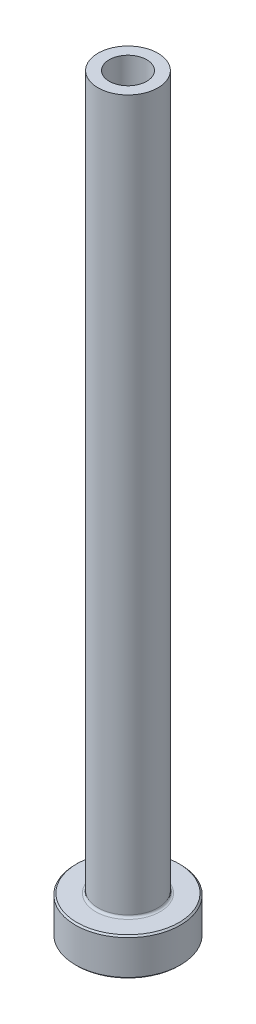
ISO-10303-21;
HEADER;
FILE_DESCRIPTION(('STEP AP214'),'2;1');
FILE_NAME('part.step','',(''),(''),'','','');
FILE_SCHEMA(('AUTOMOTIVE_DESIGN { 1 0 10303 214 1 1 1 1 }'));
ENDSEC;
DATA;
#1=APPLICATION_CONTEXT('core data for automotive mechanical design processes');
#2=APPLICATION_PROTOCOL_DEFINITION('international standard','automotive_design',2000,#1);
#3=PRODUCT_CONTEXT('',#1,'mechanical');
#4=PRODUCT('Part','Part','',(#3));
#5=PRODUCT_RELATED_PRODUCT_CATEGORY('part','',(#4));
#6=PRODUCT_DEFINITION_FORMATION('','',#4);
#7=PRODUCT_DEFINITION_CONTEXT('part definition',#1,'design');
#8=PRODUCT_DEFINITION('design','',#6,#7);
#9=PRODUCT_DEFINITION_SHAPE('','',#8);
#10=(LENGTH_UNIT() NAMED_UNIT(*) SI_UNIT(.MILLI.,.METRE.));
#11=(NAMED_UNIT(*) PLANE_ANGLE_UNIT() SI_UNIT($,.RADIAN.));
#12=(NAMED_UNIT(*) SI_UNIT($,.STERADIAN.) SOLID_ANGLE_UNIT());
#13=UNCERTAINTY_MEASURE_WITH_UNIT(LENGTH_MEASURE(1.E-05),#10,'distance_accuracy_value','');
#14=(GEOMETRIC_REPRESENTATION_CONTEXT(3) GLOBAL_UNCERTAINTY_ASSIGNED_CONTEXT((#13)) GLOBAL_UNIT_ASSIGNED_CONTEXT((#10,
#11,#12)) REPRESENTATION_CONTEXT('',''));
#15=CARTESIAN_POINT('',(0.,0.,0.));
#16=DIRECTION('',(0.,0.,1.));
#17=DIRECTION('',(1.,0.,0.));
#18=AXIS2_PLACEMENT_3D('',#15,#16,#17);
#19=CARTESIAN_POINT('',(0.,92.1876809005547,0.));
#20=DIRECTION('',(0.,1.,0.));
#21=DIRECTION('',(0.,0.,1.));
#22=AXIS2_PLACEMENT_3D('',#19,#20,#21);
#23=CYLINDRICAL_SURFACE('',#22,2.49999999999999);
#24=CARTESIAN_POINT('',(0.,100.,0.));
#25=DIRECTION('',(0.,1.,0.));
#26=DIRECTION('',(0.,0.,1.));
#27=AXIS2_PLACEMENT_3D('',#24,#25,#26);
#28=CIRCLE('',#27,2.49999999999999);
#29=CARTESIAN_POINT('',(0.,100.,2.49999999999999));
#30=VERTEX_POINT('',#29);
#31=EDGE_CURVE('E62',#30,#30,#28,.T.);
#32=ORIENTED_EDGE('',*,*,#31,.T.);
#33=EDGE_LOOP('',(#32));
#34=FACE_BOUND('',#33,.T.);
#35=CARTESIAN_POINT('',(0.,55.,0.));
#36=DIRECTION('',(0.,1.,0.));
#37=DIRECTION('',(0.,0.,1.));
#38=AXIS2_PLACEMENT_3D('',#35,#36,#37);
#39=CIRCLE('',#38,2.49999999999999);
#40=CARTESIAN_POINT('',(0.,55.,2.49999999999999));
#41=VERTEX_POINT('',#40);
#42=EDGE_CURVE('E71',#41,#41,#39,.T.);
#43=ORIENTED_EDGE('',*,*,#42,.F.);
#44=EDGE_LOOP('',(#43));
#45=FACE_BOUND('',#44,.T.);
#46=ADVANCED_FACE('F30',(#34,#45),#23,.F.);
#47=CARTESIAN_POINT('',(-2.49999999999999,100.,0.));
#48=DIRECTION('',(0.,1.,0.));
#49=DIRECTION('',(0.,0.,1.));
#50=AXIS2_PLACEMENT_3D('',#47,#48,#49);
#51=PLANE('',#50);
#52=CARTESIAN_POINT('',(0.,100.,0.));
#53=DIRECTION('',(0.,1.,0.));
#54=DIRECTION('',(0.,0.,1.));
#55=AXIS2_PLACEMENT_3D('',#52,#53,#54);
#56=CIRCLE('',#55,4.);
#57=CARTESIAN_POINT('',(0.,100.,4.));
#58=VERTEX_POINT('',#57);
#59=EDGE_CURVE('E65',#58,#58,#56,.T.);
#60=ORIENTED_EDGE('',*,*,#59,.T.);
#61=EDGE_LOOP('',(#60));
#62=FACE_BOUND('',#61,.T.);
#63=ORIENTED_EDGE('',*,*,#31,.F.);
#64=EDGE_LOOP('',(#63));
#65=FACE_BOUND('',#64,.T.);
#66=ADVANCED_FACE('F79',(#62,#65),#51,.T.);
#67=CARTESIAN_POINT('',(0.,92.1876809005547,0.));
#68=DIRECTION('',(0.,1.,0.));
#69=DIRECTION('',(0.,0.,1.));
#70=AXIS2_PLACEMENT_3D('',#67,#68,#69);
#71=CYLINDRICAL_SURFACE('',#70,4.);
#72=CARTESIAN_POINT('',(0.,5.3,0.));
#73=DIRECTION('',(0.,1.,0.));
#74=DIRECTION('',(0.,0.,1.));
#75=AXIS2_PLACEMENT_3D('',#72,#73,#74);
#76=CIRCLE('',#75,4.);
#77=CARTESIAN_POINT('',(0.,5.3,4.));
#78=VERTEX_POINT('',#77);
#79=EDGE_CURVE('E59',#78,#78,#76,.T.);
#80=ORIENTED_EDGE('',*,*,#79,.T.);
#81=EDGE_LOOP('',(#80));
#82=FACE_BOUND('',#81,.T.);
#83=ORIENTED_EDGE('',*,*,#59,.F.);
#84=EDGE_LOOP('',(#83));
#85=FACE_BOUND('',#84,.T.);
#86=ADVANCED_FACE('F85',(#82,#85),#71,.T.);
#87=CARTESIAN_POINT('',(-3.99999999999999,5.,0.));
#88=DIRECTION('',(0.,1.,0.));
#89=DIRECTION('',(0.,0.,1.));
#90=AXIS2_PLACEMENT_3D('',#87,#88,#89);
#91=PLANE('',#90);
#92=CARTESIAN_POINT('',(0.,5.,0.));
#93=DIRECTION('',(0.,1.,0.));
#94=DIRECTION('',(0.,0.,1.));
#95=AXIS2_PLACEMENT_3D('',#92,#93,#94);
#96=CIRCLE('',#95,6.79999999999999);
#97=CARTESIAN_POINT('',(0.,5.,6.79999999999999));
#98=VERTEX_POINT('',#97);
#99=EDGE_CURVE('E53',#98,#98,#96,.T.);
#100=ORIENTED_EDGE('',*,*,#99,.T.);
#101=EDGE_LOOP('',(#100));
#102=FACE_BOUND('',#101,.T.);
#103=CARTESIAN_POINT('',(0.,5.,0.));
#104=DIRECTION('',(0.,1.,0.));
#105=DIRECTION('',(0.,0.,1.));
#106=AXIS2_PLACEMENT_3D('',#103,#104,#105);
#107=CIRCLE('',#106,4.3);
#108=CARTESIAN_POINT('',(0.,5.,4.3));
#109=VERTEX_POINT('',#108);
#110=EDGE_CURVE('E56',#109,#109,#107,.F.);
#111=ORIENTED_EDGE('',*,*,#110,.T.);
#112=EDGE_LOOP('',(#111));
#113=FACE_BOUND('',#112,.T.);
#114=ADVANCED_FACE('F111',(#102,#113),#91,.T.);
#115=CARTESIAN_POINT('',(0.,92.1876809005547,0.));
#116=DIRECTION('',(0.,1.,0.));
#117=DIRECTION('',(0.,0.,1.));
#118=AXIS2_PLACEMENT_3D('',#115,#116,#117);
#119=CYLINDRICAL_SURFACE('',#118,6.99999999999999);
#120=CARTESIAN_POINT('',(0.,4.8,0.));
#121=DIRECTION('',(0.,1.,0.));
#122=DIRECTION('',(0.,0.,1.));
#123=AXIS2_PLACEMENT_3D('',#120,#121,#122);
#124=CIRCLE('',#123,6.99999999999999);
#125=CARTESIAN_POINT('',(0.,4.8,6.99999999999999));
#126=VERTEX_POINT('',#125);
#127=EDGE_CURVE('E45',#126,#126,#124,.F.);
#128=ORIENTED_EDGE('',*,*,#127,.T.);
#129=EDGE_LOOP('',(#128));
#130=FACE_BOUND('',#129,.T.);
#131=CARTESIAN_POINT('',(0.,0.199999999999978,0.));
#132=DIRECTION('',(0.,-1.,0.));
#133=DIRECTION('',(0.,0.,-1.));
#134=AXIS2_PLACEMENT_3D('',#131,#132,#133);
#135=CIRCLE('',#134,6.99999999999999);
#136=CARTESIAN_POINT('',(0.,0.199999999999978,6.99999999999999));
#137=VERTEX_POINT('',#136);
#138=EDGE_CURVE('E50',#137,#137,#135,.F.);
#139=ORIENTED_EDGE('',*,*,#138,.T.);
#140=EDGE_LOOP('',(#139));
#141=FACE_BOUND('',#140,.T.);
#142=ADVANCED_FACE('F108',(#130,#141),#119,.T.);
#143=CARTESIAN_POINT('',(-6.99999999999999,0.,0.));
#144=DIRECTION('',(0.,-1.,0.));
#145=DIRECTION('',(0.,0.,-1.));
#146=AXIS2_PLACEMENT_3D('',#143,#144,#145);
#147=PLANE('',#146);
#148=CARTESIAN_POINT('',(0.,0.,0.));
#149=DIRECTION('',(0.,-1.,0.));
#150=DIRECTION('',(0.,0.,-1.));
#151=AXIS2_PLACEMENT_3D('',#148,#149,#150);
#152=CIRCLE('',#151,3.24999999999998);
#153=CARTESIAN_POINT('',(0.,0.,-3.24999999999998));
#154=VERTEX_POINT('',#153);
#155=EDGE_CURVE('E37',#154,#154,#152,.F.);
#156=ORIENTED_EDGE('',*,*,#155,.T.);
#157=EDGE_LOOP('',(#156));
#158=FACE_BOUND('',#157,.T.);
#159=CARTESIAN_POINT('',(0.,0.,0.));
#160=DIRECTION('',(0.,-1.,0.));
#161=DIRECTION('',(0.,0.,-1.));
#162=AXIS2_PLACEMENT_3D('',#159,#160,#161);
#163=CIRCLE('',#162,6.80000000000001);
#164=CARTESIAN_POINT('',(0.,0.,6.80000000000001));
#165=VERTEX_POINT('',#164);
#166=EDGE_CURVE('E41',#165,#165,#163,.T.);
#167=ORIENTED_EDGE('',*,*,#166,.T.);
#168=EDGE_LOOP('',(#167));
#169=FACE_BOUND('',#168,.T.);
#170=ADVANCED_FACE('F110',(#158,#169),#147,.T.);
#171=CARTESIAN_POINT('',(0.,92.1876809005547,0.));
#172=DIRECTION('',(0.,1.,0.));
#173=DIRECTION('',(0.,0.,1.));
#174=AXIS2_PLACEMENT_3D('',#171,#172,#173);
#175=CYLINDRICAL_SURFACE('',#174,2.74999999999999);
#176=CARTESIAN_POINT('',(0.,0.499999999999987,0.));
#177=DIRECTION('',(0.,-1.,0.));
#178=DIRECTION('',(0.,0.,-1.));
#179=AXIS2_PLACEMENT_3D('',#176,#177,#178);
#180=CIRCLE('',#179,2.74999999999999);
#181=CARTESIAN_POINT('',(0.,0.499999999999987,-2.74999999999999));
#182=VERTEX_POINT('',#181);
#183=EDGE_CURVE('E10',#182,#182,#180,.T.);
#184=ORIENTED_EDGE('',*,*,#183,.T.);
#185=EDGE_LOOP('',(#184));
#186=FACE_BOUND('',#185,.T.);
#187=CARTESIAN_POINT('',(0.,43.,0.));
#188=DIRECTION('',(0.,1.,0.));
#189=DIRECTION('',(0.,0.,1.));
#190=AXIS2_PLACEMENT_3D('',#187,#188,#189);
#191=CIRCLE('',#190,2.75);
#192=CARTESIAN_POINT('',(0.,43.,2.75));
#193=VERTEX_POINT('',#192);
#194=EDGE_CURVE('E68',#193,#193,#191,.T.);
#195=ORIENTED_EDGE('',*,*,#194,.T.);
#196=EDGE_LOOP('',(#195));
#197=FACE_BOUND('',#196,.T.);
#198=ADVANCED_FACE('F118',(#186,#197),#175,.F.);
#199=CARTESIAN_POINT('',(0.,43.,0.));
#200=DIRECTION('',(0.,-1.,0.));
#201=DIRECTION('',(0.,0.,-1.));
#202=AXIS2_PLACEMENT_3D('',#199,#200,#201);
#203=CONICAL_SURFACE('',#202,2.75,0.0208303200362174);
#204=ORIENTED_EDGE('',*,*,#42,.T.);
#205=EDGE_LOOP('',(#204));
#206=FACE_BOUND('',#205,.T.);
#207=ORIENTED_EDGE('',*,*,#194,.F.);
#208=EDGE_LOOP('',(#207));
#209=FACE_BOUND('',#208,.T.);
#210=ADVANCED_FACE('F75',(#206,#209),#203,.F.);
#211=CARTESIAN_POINT('',(0.,5.3,0.));
#212=DIRECTION('',(0.,1.,0.));
#213=DIRECTION('',(0.,0.,1.));
#214=AXIS2_PLACEMENT_3D('',#211,#212,#213);
#215=TOROIDAL_SURFACE('',#214,4.3,0.3);
#216=ORIENTED_EDGE('',*,*,#110,.F.);
#217=EDGE_LOOP('',(#216));
#218=FACE_BOUND('',#217,.T.);
#219=ORIENTED_EDGE('',*,*,#79,.F.);
#220=EDGE_LOOP('',(#219));
#221=FACE_BOUND('',#220,.T.);
#222=ADVANCED_FACE('F90',(#218,#221),#215,.F.);
#223=CARTESIAN_POINT('',(0.,5.,0.));
#224=DIRECTION('',(0.,-1.,0.));
#225=DIRECTION('',(0.,0.,-1.));
#226=AXIS2_PLACEMENT_3D('',#223,#224,#225);
#227=CONICAL_SURFACE('',#226,6.79999999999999,0.78539816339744);
#228=ORIENTED_EDGE('',*,*,#127,.F.);
#229=EDGE_LOOP('',(#228));
#230=FACE_BOUND('',#229,.T.);
#231=ORIENTED_EDGE('',*,*,#99,.F.);
#232=EDGE_LOOP('',(#231));
#233=FACE_BOUND('',#232,.T.);
#234=ADVANCED_FACE('F93',(#230,#233),#227,.T.);
#235=CARTESIAN_POINT('',(0.,0.199999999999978,0.));
#236=DIRECTION('',(0.,1.,0.));
#237=DIRECTION('',(0.,0.,1.));
#238=AXIS2_PLACEMENT_3D('',#235,#236,#237);
#239=CONICAL_SURFACE('',#238,6.99999999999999,0.78539816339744);
#240=CARTESIAN_POINT('',(0.,0.,6.80000000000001));
#241=CARTESIAN_POINT('',(0.,0.00208333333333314,6.80208333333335));
#242=CARTESIAN_POINT('',(0.,0.00416666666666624,6.80416666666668));
#243=CARTESIAN_POINT('',(0.,0.00833333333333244,6.80833333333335));
#244=CARTESIAN_POINT('',(0.,0.0104166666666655,6.81041666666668));
#245=CARTESIAN_POINT('',(0.,0.0145833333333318,6.81458333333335));
#246=CARTESIAN_POINT('',(0.,0.0166666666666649,6.81666666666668));
#247=CARTESIAN_POINT('',(0.,0.020833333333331,6.82083333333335));
#248=CARTESIAN_POINT('',(0.,0.0229166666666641,6.82291666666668));
#249=CARTESIAN_POINT('',(0.,0.0270833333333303,6.82708333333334));
#250=CARTESIAN_POINT('',(0.,0.0291666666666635,6.82916666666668));
#251=CARTESIAN_POINT('',(0.,0.0333333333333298,6.83333333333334));
#252=CARTESIAN_POINT('',(0.,0.0354166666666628,6.83541666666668));
#253=CARTESIAN_POINT('',(0.,0.039583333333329,6.83958333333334));
#254=CARTESIAN_POINT('',(0.,0.0416666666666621,6.84166666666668));
#255=CARTESIAN_POINT('',(0.,0.0458333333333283,6.84583333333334));
#256=CARTESIAN_POINT('',(0.,0.0479166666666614,6.84791666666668));
#257=CARTESIAN_POINT('',(0.,0.0520833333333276,6.85208333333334));
#258=CARTESIAN_POINT('',(0.,0.0541666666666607,6.85416666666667));
#259=CARTESIAN_POINT('',(0.,0.0583333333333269,6.85833333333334));
#260=CARTESIAN_POINT('',(0.,0.0604166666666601,6.86041666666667));
#261=CARTESIAN_POINT('',(0.,0.0645833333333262,6.86458333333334));
#262=CARTESIAN_POINT('',(0.,0.0666666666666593,6.86666666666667));
#263=CARTESIAN_POINT('',(0.,0.0708333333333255,6.87083333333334));
#264=CARTESIAN_POINT('',(0.,0.0729166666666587,6.87291666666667));
#265=CARTESIAN_POINT('',(0.,0.077083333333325,6.87708333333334));
#266=CARTESIAN_POINT('',(0.,0.079166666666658,6.87916666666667));
#267=CARTESIAN_POINT('',(0.,0.0833333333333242,6.88333333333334));
#268=CARTESIAN_POINT('',(0.,0.0854166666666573,6.88541666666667));
#269=CARTESIAN_POINT('',(0.,0.0895833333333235,6.88958333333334));
#270=CARTESIAN_POINT('',(0.,0.0916666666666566,6.89166666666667));
#271=CARTESIAN_POINT('',(0.,0.0958333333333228,6.89583333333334));
#272=CARTESIAN_POINT('',(0.,0.0979166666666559,6.89791666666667));
#273=CARTESIAN_POINT('',(0.,0.102083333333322,6.90208333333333));
#274=CARTESIAN_POINT('',(0.,0.104166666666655,6.90416666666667));
#275=CARTESIAN_POINT('',(0.,0.108333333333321,6.90833333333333));
#276=CARTESIAN_POINT('',(0.,0.110416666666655,6.91041666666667));
#277=CARTESIAN_POINT('',(0.,0.114583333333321,6.91458333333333));
#278=CARTESIAN_POINT('',(0.,0.116666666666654,6.91666666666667));
#279=CARTESIAN_POINT('',(0.,0.12083333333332,6.92083333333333));
#280=CARTESIAN_POINT('',(0.,0.122916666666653,6.92291666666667));
#281=CARTESIAN_POINT('',(0.,0.127083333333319,6.92708333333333));
#282=CARTESIAN_POINT('',(0.,0.129166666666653,6.92916666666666));
#283=CARTESIAN_POINT('',(0.,0.133333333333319,6.93333333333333));
#284=CARTESIAN_POINT('',(0.,0.135416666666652,6.93541666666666));
#285=CARTESIAN_POINT('',(0.,0.139583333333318,6.93958333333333));
#286=CARTESIAN_POINT('',(0.,0.141666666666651,6.94166666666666));
#287=CARTESIAN_POINT('',(0.,0.145833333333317,6.94583333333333));
#288=CARTESIAN_POINT('',(0.,0.14791666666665,6.94791666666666));
#289=CARTESIAN_POINT('',(0.,0.152083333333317,6.95208333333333));
#290=CARTESIAN_POINT('',(0.,0.15416666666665,6.95416666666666));
#291=CARTESIAN_POINT('',(0.,0.158333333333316,6.95833333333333));
#292=CARTESIAN_POINT('',(0.,0.160416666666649,6.96041666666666));
#293=CARTESIAN_POINT('',(0.,0.164583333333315,6.96458333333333));
#294=CARTESIAN_POINT('',(0.,0.166666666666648,6.96666666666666));
#295=CARTESIAN_POINT('',(0.,0.170833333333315,6.97083333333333));
#296=CARTESIAN_POINT('',(0.,0.172916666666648,6.97291666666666));
#297=CARTESIAN_POINT('',(0.,0.177083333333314,6.97708333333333));
#298=CARTESIAN_POINT('',(0.,0.179166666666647,6.97916666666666));
#299=CARTESIAN_POINT('',(0.,0.183333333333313,6.98333333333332));
#300=CARTESIAN_POINT('',(0.,0.185416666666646,6.98541666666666));
#301=CARTESIAN_POINT('',(0.,0.189583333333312,6.98958333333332));
#302=CARTESIAN_POINT('',(0.,0.191666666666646,6.99166666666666));
#303=CARTESIAN_POINT('',(0.,0.195833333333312,6.99583333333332));
#304=CARTESIAN_POINT('',(0.,0.197916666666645,6.99791666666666));
#305=CARTESIAN_POINT('',(0.,0.199999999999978,6.99999999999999));
#306=B_SPLINE_CURVE_WITH_KNOTS('',3,(#240,#241,#242,#243,#244,#245,#246,#247,#248,#249,#250,
#251,#252,#253,#254,#255,#256,#257,#258,#259,#260,#261,#262,#263,#264,#265,#266,#267,#268,#269,
#270,#271,#272,#273,#274,#275,#276,#277,#278,#279,#280,#281,#282,#283,#284,#285,#286,#287,#288,
#289,#290,#291,#292,#293,#294,#295,#296,#297,#298,#299,#300,#301,#302,#303,#304,#305),
.UNSPECIFIED.,.F.,.F.,(4,2,2,2,2,2,2,2,2,2,2,2,2,2,2,2,2,2,2,2,2,2,2,2,2,2,2,2,2,2,2,2,4),(0.,
0.00883883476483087,0.0176776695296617,0.0265165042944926,0.0353553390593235,0.0441941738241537,
0.0530330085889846,0.0618718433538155,0.0707106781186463,0.0795495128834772,0.0883883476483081,
0.0972271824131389,0.106066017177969,0.1149048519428,0.123743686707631,0.132582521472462,
0.141421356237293,0.150260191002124,0.159099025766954,0.167937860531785,0.176776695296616,
0.185615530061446,0.194454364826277,0.203293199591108,0.212132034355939,0.22097086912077,
0.229809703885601,0.238648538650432,0.247487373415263,0.256326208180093,0.265165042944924,
0.274003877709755,0.282842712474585),.UNSPECIFIED.);
#307=EDGE_CURVE('BSEAM96',#165,#137,#306,.T.);
#308=ORIENTED_EDGE('',*,*,#166,.F.);
#309=ORIENTED_EDGE('',*,*,#138,.F.);
#310=ORIENTED_EDGE('',*,*,#307,.T.);
#311=ORIENTED_EDGE('',*,*,#307,.F.);
#312=EDGE_LOOP('',(#308,#310,#309,#311));
#313=FACE_BOUND('',#312,.T.);
#314=ADVANCED_FACE('F96',(#313),#239,.T.);
#315=CARTESIAN_POINT('',(0.,0.,0.));
#316=DIRECTION('',(0.,-1.,0.));
#317=DIRECTION('',(0.,0.,-1.));
#318=AXIS2_PLACEMENT_3D('',#315,#316,#317);
#319=CONICAL_SURFACE('',#318,3.24999999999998,0.785398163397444);
#320=ORIENTED_EDGE('',*,*,#183,.F.);
#321=EDGE_LOOP('',(#320));
#322=FACE_BOUND('',#321,.T.);
#323=ORIENTED_EDGE('',*,*,#155,.F.);
#324=EDGE_LOOP('',(#323));
#325=FACE_BOUND('',#324,.T.);
#326=ADVANCED_FACE('F32',(#322,#325),#319,.F.);
#327=CLOSED_SHELL('',(#46,#66,#86,#114,#142,#170,#198,#210,#222,#234,#314,#326));
#328=MANIFOLD_SOLID_BREP('B2',#327);
#329=ADVANCED_BREP_SHAPE_REPRESENTATION('',(#18,#328),#14);
#330=SHAPE_DEFINITION_REPRESENTATION(#9,#329);
ENDSEC;
END-ISO-10303-21;
